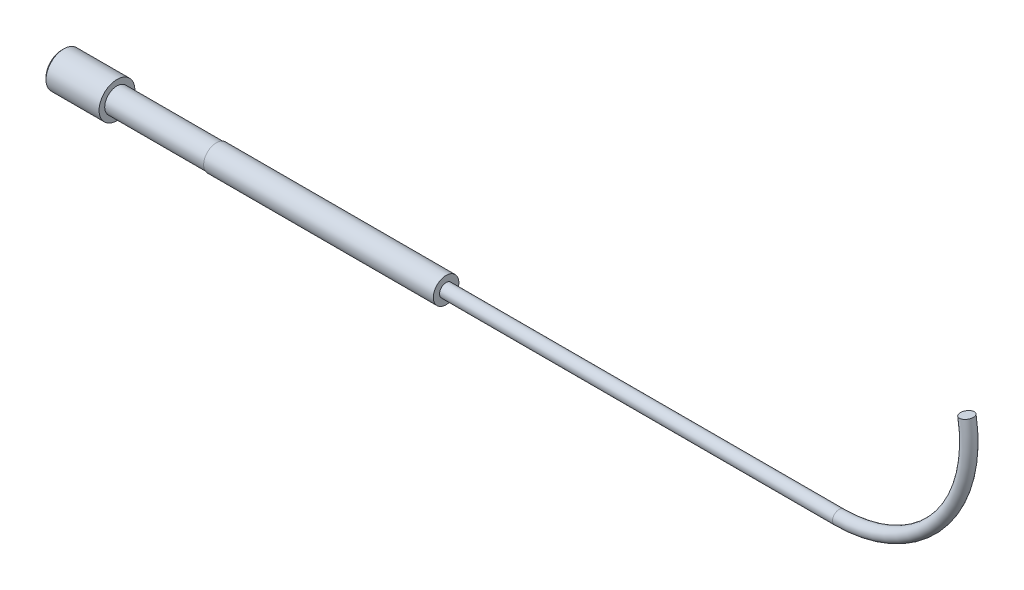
from build123d import *

# Parameters (mm, degrees)
SKETCH2_R     = 0.8128
CHAMFER1_SIZE = 0.254


with BuildPart() as part:
    # Sketch1 → Revolve1 (revolve)
    with BuildSketch(Plane.XY, mode=Mode.PRIVATE) as revolve1_sk:
        Polygon((0, 2.2225), (6.858, 2.2225), (6.858, 1.524), (19.2278, 1.524), (19.2278, 1.5875), (47.8028, 1.5875), (47.8028, 0), (1.27, 0), (1.27, 0.254), (4.7625, 0.254), (4.7625, 1.651), (0, 1.651), align=None)
    revolve(revolve1_sk.sketch.rotate(Axis((0, 0, 0), (1, 0, 0)), 90), axis=Axis((0, 0, 0), (1, 0, 0)))

    # Sweep1: sweep along a curve in space
    with BuildLine() as sweep1_path:
        Line((47.8028, 0, 0), (96.683114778, 0, 0))
        ThreePointArc((96.683114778, 0, 0), (109.046242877, 5.762463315, 0), (112.583283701, 18.936007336, 0))
    # Sketch2 → Sweep1 (sweep)
    with BuildSketch(Plane(origin=(47.8028, 0, 0), x_dir=(0, 0, -1), z_dir=(1, 0, 0))):
        Circle(SKETCH2_R)
    sweep(path=sweep1_path.line)

    # Chamfer1
    chamfer1_edges = [part.edges().sort_by_distance(p)[0] for p in [
        (0, 0, -2.2225),
    ]]
    chamfer(chamfer1_edges, length=CHAMFER1_SIZE)


solid = part.part
